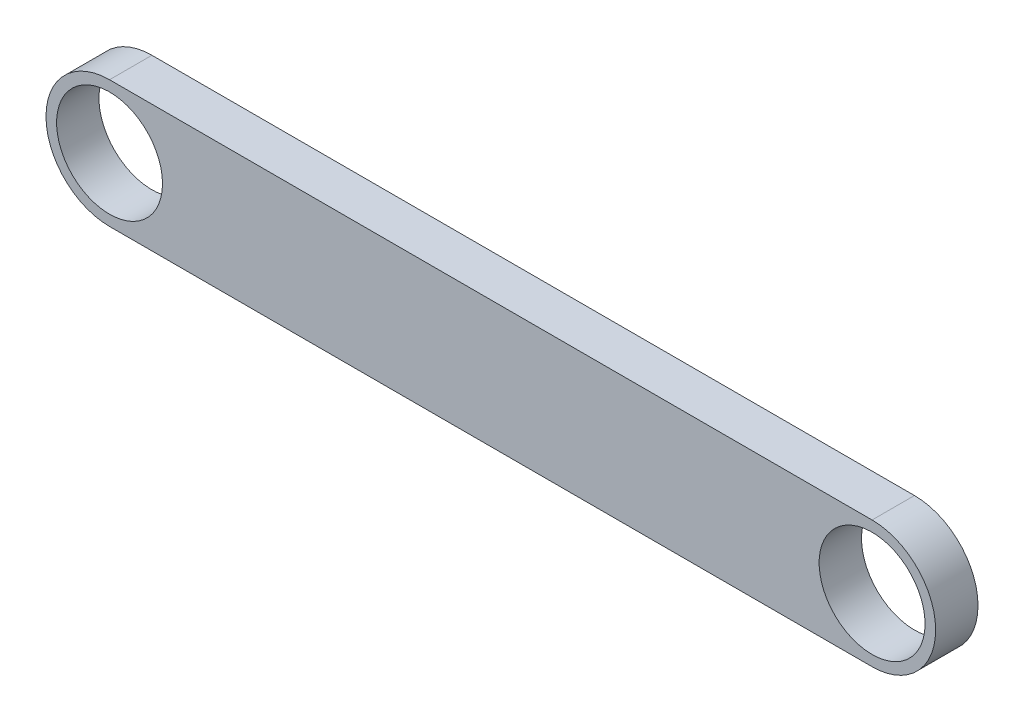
from build123d import *

# Parameters (mm, degrees)
SKETCH1_R           = 12.5
BOSS_EXTRUDE1_DEPTH = 10


with BuildPart() as part:
    # Sketch1 → Boss-Extrude1 (new body)
    with BuildSketch(Plane.XY):
        with BuildLine():
            Line((0, 15), (180, 15))
            ThreePointArc((180, 15), (195, 0), (180, -15))
            Line((180, -15), (0, -15))
            ThreePointArc((0, -15), (-15, 0), (0, 15))
        make_face()
        Circle(SKETCH1_R, mode=Mode.SUBTRACT)
        with Locations((180, 0)):
            Circle(SKETCH1_R, mode=Mode.SUBTRACT)
    extrude(amount=BOSS_EXTRUDE1_DEPTH)


solid = part.part
